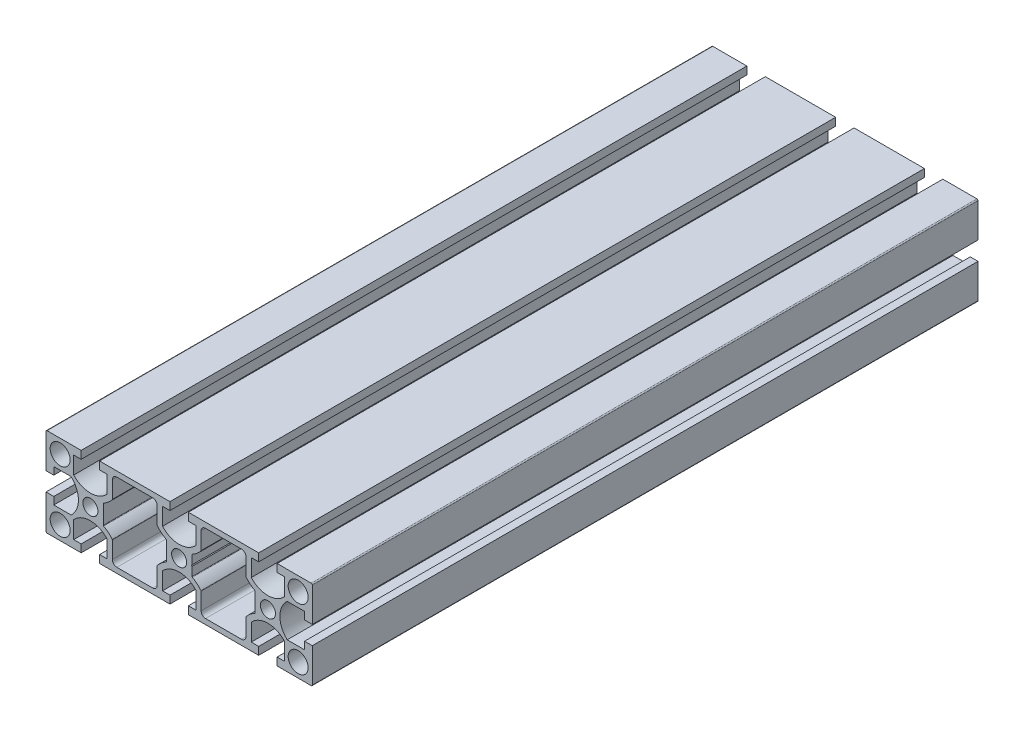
from build123d import *

# Parameters (mm, degrees)
MODEL_R         = 4.5
MODEL_R_2       = 3.4
EXTRUDE_1_DEPTH = 300


with BuildPart() as part:
    # Model → Extrude 1 (new body)
    with BuildSketch(Plane.XY):
        with BuildLine():
            Line((2056.030750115, 1297.805577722), (2056.030750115, 1305.605577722))
            Line((2056.030750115, 1305.605577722), (2059.380750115, 1305.605577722))
            Line((2059.380750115, 1305.605577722), (2059.380750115, 1309.105577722))
            Line((2059.380750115, 1309.105577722), (2044.030750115, 1309.105577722))
            ThreePointArc((2044.030750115, 1309.105577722), (2043.677196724, 1308.959131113), (2043.530750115, 1308.605577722))
            Line((2043.530750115, 1308.605577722), (2043.530750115, 1293.255577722))
            Line((2043.530750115, 1293.255577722), (2047.030750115, 1293.255577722))
            Line((2047.030750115, 1293.255577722), (2047.030750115, 1296.605577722))
            Line((2047.030750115, 1296.605577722), (2054.830750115, 1296.605577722))
            ThreePointArc((2054.830750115, 1296.605577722), (2058.130750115, 1289.105577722), (2054.830750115, 1281.605577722))
            Line((2054.830750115, 1281.605577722), (2047.030750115, 1281.605577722))
            Line((2047.030750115, 1281.605577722), (2047.030750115, 1284.955577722))
            Line((2047.030750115, 1284.955577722), (2043.530750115, 1284.955577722))
            Line((2043.530750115, 1284.955577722), (2043.530750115, 1269.605577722))
            ThreePointArc((2043.530750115, 1269.605577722), (2043.677196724, 1269.252024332), (2044.030750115, 1269.105577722))
            Line((2044.030750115, 1269.105577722), (2059.380750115, 1269.105577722))
            Line((2059.380750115, 1269.105577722), (2059.380750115, 1272.605577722))
            Line((2059.380750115, 1272.605577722), (2056.030750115, 1272.605577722))
            Line((2056.030750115, 1272.605577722), (2056.030750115, 1280.405577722))
            ThreePointArc((2056.030750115, 1280.405577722), (2063.530750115, 1283.705577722), (2071.030750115, 1280.405577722))
            Line((2071.030750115, 1280.405577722), (2071.030750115, 1272.605577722))
            Line((2071.030750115, 1272.605577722), (2067.680750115, 1272.605577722))
            Line((2067.680750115, 1272.605577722), (2067.680750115, 1269.105577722))
            Line((2067.680750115, 1269.105577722), (2099.380750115, 1269.105577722))
            Line((2099.380750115, 1269.105577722), (2099.380750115, 1272.605577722))
            Line((2099.380750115, 1272.605577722), (2096.030750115, 1272.605577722))
            Line((2096.030750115, 1272.605577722), (2096.030750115, 1280.405577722))
            ThreePointArc((2096.030750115, 1280.405577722), (2103.530750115, 1283.705577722), (2111.030750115, 1280.405577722))
            Line((2111.030750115, 1280.405577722), (2111.030750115, 1272.605577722))
            Line((2111.030750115, 1272.605577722), (2107.680750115, 1272.605577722))
            Line((2107.680750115, 1272.605577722), (2107.680750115, 1269.105577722))
            Line((2107.680750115, 1269.105577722), (2139.380750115, 1269.105577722))
            Line((2139.380750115, 1269.105577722), (2139.380750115, 1272.605577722))
            Line((2139.380750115, 1272.605577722), (2136.030750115, 1272.605577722))
            Line((2136.030750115, 1272.605577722), (2136.030750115, 1280.405577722))
            ThreePointArc((2136.030750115, 1280.405577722), (2143.530750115, 1283.705577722), (2151.030750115, 1280.405577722))
            Line((2151.030750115, 1280.405577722), (2151.030750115, 1272.605577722))
            Line((2151.030750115, 1272.605577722), (2147.680750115, 1272.605577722))
            Line((2147.680750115, 1272.605577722), (2147.680750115, 1269.105577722))
            Line((2147.680750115, 1269.105577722), (2163.030750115, 1269.105577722))
            ThreePointArc((2163.030750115, 1269.105577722), (2163.384303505, 1269.252024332), (2163.530750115, 1269.605577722))
            Line((2163.530750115, 1269.605577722), (2163.530750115, 1284.955577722))
            Line((2163.530750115, 1284.955577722), (2160.030750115, 1284.955577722))
            Line((2160.030750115, 1284.955577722), (2160.030750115, 1281.605577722))
            Line((2160.030750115, 1281.605577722), (2152.230750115, 1281.605577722))
            ThreePointArc((2152.230750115, 1281.605577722), (2148.930750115, 1289.105577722), (2152.230750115, 1296.605577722))
            Line((2152.230750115, 1296.605577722), (2160.030750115, 1296.605577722))
            Line((2160.030750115, 1296.605577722), (2160.030750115, 1293.255577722))
            Line((2160.030750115, 1293.255577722), (2163.530750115, 1293.255577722))
            Line((2163.530750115, 1293.255577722), (2163.530750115, 1308.605577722))
            ThreePointArc((2163.530750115, 1308.605577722), (2163.384303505, 1308.959131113), (2163.030750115, 1309.105577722))
            Line((2163.030750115, 1309.105577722), (2147.680750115, 1309.105577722))
            Line((2147.680750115, 1309.105577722), (2147.680750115, 1305.605577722))
            Line((2147.680750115, 1305.605577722), (2151.030750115, 1305.605577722))
            Line((2151.030750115, 1305.605577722), (2151.030750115, 1297.805577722))
            ThreePointArc((2151.030750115, 1297.805577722), (2143.530750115, 1294.505577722), (2136.030750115, 1297.805577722))
            Line((2136.030750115, 1297.805577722), (2136.030750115, 1305.605577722))
            Line((2136.030750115, 1305.605577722), (2139.380750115, 1305.605577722))
            Line((2139.380750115, 1305.605577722), (2139.380750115, 1309.105577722))
            Line((2139.380750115, 1309.105577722), (2107.680750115, 1309.105577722))
            Line((2107.680750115, 1309.105577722), (2107.680750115, 1305.605577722))
            Line((2107.680750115, 1305.605577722), (2111.030750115, 1305.605577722))
            Line((2111.030750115, 1305.605577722), (2111.030750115, 1297.805577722))
            ThreePointArc((2111.030750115, 1297.805577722), (2103.530750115, 1294.505577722), (2096.030750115, 1297.805577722))
            Line((2096.030750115, 1297.805577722), (2096.030750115, 1305.605577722))
            Line((2096.030750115, 1305.605577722), (2099.380750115, 1305.605577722))
            Line((2099.380750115, 1305.605577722), (2099.380750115, 1309.105577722))
            Line((2099.380750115, 1309.105577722), (2067.680750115, 1309.105577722))
            Line((2067.680750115, 1309.105577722), (2067.680750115, 1305.605577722))
            Line((2067.680750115, 1305.605577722), (2071.030750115, 1305.605577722))
            Line((2071.030750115, 1305.605577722), (2071.030750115, 1297.805577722))
            ThreePointArc((2071.030750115, 1297.805577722), (2063.530750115, 1294.505577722), (2056.030750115, 1297.805577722))
        make_face()
        with Locations((2049.905750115, 1302.855577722)):
            Circle(MODEL_R, mode=Mode.SUBTRACT)
        with Locations((2049.905750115, 1275.355577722)):
            Circle(MODEL_R, mode=Mode.SUBTRACT)
        with Locations((2063.530750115, 1289.105577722)):
            Circle(MODEL_R_2, mode=Mode.SUBTRACT)
        with Locations((2103.530750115, 1289.105577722)):
            Circle(MODEL_R_2, mode=Mode.SUBTRACT)
        with Locations((2157.155750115, 1302.855577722)):
            Circle(MODEL_R, mode=Mode.SUBTRACT)
        with Locations((2143.530750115, 1289.105577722)):
            Circle(MODEL_R_2, mode=Mode.SUBTRACT)
        with Locations((2157.155750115, 1275.355577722)):
            Circle(MODEL_R, mode=Mode.SUBTRACT)
        with BuildLine():
            Line((2069.330750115, 1293.342648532), (2069.330750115, 1284.868506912))
            ThreePointArc((2069.330750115, 1284.868506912), (2069.373215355, 1284.714637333), (2069.488589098, 1284.604328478))
            ThreePointArc((2069.488589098, 1284.604328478), (2071.591337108, 1283.181705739), (2073.365416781, 1281.365653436))
            ThreePointArc((2073.365416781, 1281.365653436), (2073.41394616, 1281.277748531), (2073.430750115, 1281.178753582))
            Line((2073.430750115, 1281.178753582), (2073.430750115, 1273.505577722))
            ThreePointArc((2073.430750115, 1273.505577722), (2074.016536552, 1272.09136416), (2075.430750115, 1271.505577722))
            Line((2075.430750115, 1271.505577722), (2091.630750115, 1271.505577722))
            ThreePointArc((2091.630750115, 1271.505577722), (2093.044963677, 1272.09136416), (2093.630750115, 1273.505577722))
            Line((2093.630750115, 1273.505577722), (2093.630750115, 1281.178753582))
            ThreePointArc((2093.630750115, 1281.178753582), (2093.647554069, 1281.277748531), (2093.696083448, 1281.365653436))
            ThreePointArc((2093.696083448, 1281.365653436), (2095.470163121, 1283.181705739), (2097.572911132, 1284.604328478))
            ThreePointArc((2097.572911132, 1284.604328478), (2097.688284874, 1284.714637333), (2097.730750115, 1284.868506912))
            Line((2097.730750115, 1284.868506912), (2097.730750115, 1288.805577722))
            Line((2097.730750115, 1288.805577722), (2098.030750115, 1289.105577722))
            Line((2098.030750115, 1289.105577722), (2097.730750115, 1289.405577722))
            Line((2097.730750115, 1289.405577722), (2097.730750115, 1293.342648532))
            ThreePointArc((2097.730750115, 1293.342648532), (2097.688284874, 1293.496518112), (2097.572911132, 1293.606826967))
            ThreePointArc((2097.572911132, 1293.606826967), (2095.470163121, 1295.029449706), (2093.696083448, 1296.845502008))
            ThreePointArc((2093.696083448, 1296.845502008), (2093.647554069, 1296.933406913), (2093.630750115, 1297.032401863))
            Line((2093.630750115, 1297.032401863), (2093.630750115, 1304.705577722))
            ThreePointArc((2093.630750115, 1304.705577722), (2093.044963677, 1306.119791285), (2091.630750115, 1306.705577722))
            Line((2091.630750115, 1306.705577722), (2075.430750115, 1306.705577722))
            ThreePointArc((2075.430750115, 1306.705577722), (2074.016536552, 1306.119791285), (2073.430750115, 1304.705577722))
            Line((2073.430750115, 1304.705577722), (2073.430750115, 1297.032401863))
            ThreePointArc((2073.430750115, 1297.032401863), (2073.41394616, 1296.933406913), (2073.365416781, 1296.845502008))
            ThreePointArc((2073.365416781, 1296.845502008), (2071.591337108, 1295.029449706), (2069.488589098, 1293.606826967))
            ThreePointArc((2069.488589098, 1293.606826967), (2069.373215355, 1293.496518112), (2069.330750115, 1293.342648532))
        make_face(mode=Mode.SUBTRACT)
        with BuildLine():
            Line((2137.730750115, 1284.868506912), (2137.730750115, 1293.342648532))
            ThreePointArc((2137.730750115, 1293.342648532), (2137.688284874, 1293.496518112), (2137.572911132, 1293.606826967))
            ThreePointArc((2137.572911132, 1293.606826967), (2135.470163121, 1295.029449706), (2133.696083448, 1296.845502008))
            ThreePointArc((2133.696083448, 1296.845502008), (2133.647554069, 1296.933406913), (2133.630750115, 1297.032401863))
            Line((2133.630750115, 1297.032401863), (2133.630750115, 1304.705577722))
            ThreePointArc((2133.630750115, 1304.705577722), (2133.044963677, 1306.119791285), (2131.630750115, 1306.705577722))
            Line((2131.630750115, 1306.705577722), (2115.430750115, 1306.705577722))
            ThreePointArc((2115.430750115, 1306.705577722), (2114.016536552, 1306.119791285), (2113.430750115, 1304.705577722))
            Line((2113.430750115, 1304.705577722), (2113.430750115, 1297.032401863))
            ThreePointArc((2113.430750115, 1297.032401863), (2113.41394616, 1296.933406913), (2113.365416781, 1296.845502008))
            ThreePointArc((2113.365416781, 1296.845502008), (2111.591337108, 1295.029449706), (2109.488589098, 1293.606826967))
            ThreePointArc((2109.488589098, 1293.606826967), (2109.373215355, 1293.496518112), (2109.330750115, 1293.342648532))
            Line((2109.330750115, 1293.342648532), (2109.330750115, 1289.405577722))
            Line((2109.330750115, 1289.405577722), (2109.030750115, 1289.105577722))
            Line((2109.030750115, 1289.105577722), (2109.330750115, 1288.805577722))
            Line((2109.330750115, 1288.805577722), (2109.330750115, 1284.868506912))
            ThreePointArc((2109.330750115, 1284.868506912), (2109.373215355, 1284.714637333), (2109.488589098, 1284.604328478))
            ThreePointArc((2109.488589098, 1284.604328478), (2111.591337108, 1283.181705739), (2113.365416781, 1281.365653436))
            ThreePointArc((2113.365416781, 1281.365653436), (2113.41394616, 1281.277748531), (2113.430750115, 1281.178753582))
            Line((2113.430750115, 1281.178753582), (2113.430750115, 1273.505577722))
            ThreePointArc((2113.430750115, 1273.505577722), (2114.016536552, 1272.09136416), (2115.430750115, 1271.505577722))
            Line((2115.430750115, 1271.505577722), (2131.630750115, 1271.505577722))
            ThreePointArc((2131.630750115, 1271.505577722), (2133.044963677, 1272.09136416), (2133.630750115, 1273.505577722))
            Line((2133.630750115, 1273.505577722), (2133.630750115, 1281.178753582))
            ThreePointArc((2133.630750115, 1281.178753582), (2133.647554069, 1281.277748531), (2133.696083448, 1281.365653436))
            ThreePointArc((2133.696083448, 1281.365653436), (2135.470163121, 1283.181705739), (2137.572911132, 1284.604328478))
            ThreePointArc((2137.572911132, 1284.604328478), (2137.688284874, 1284.714637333), (2137.730750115, 1284.868506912))
        make_face(mode=Mode.SUBTRACT)
    extrude(amount=EXTRUDE_1_DEPTH)


solid = part.part
